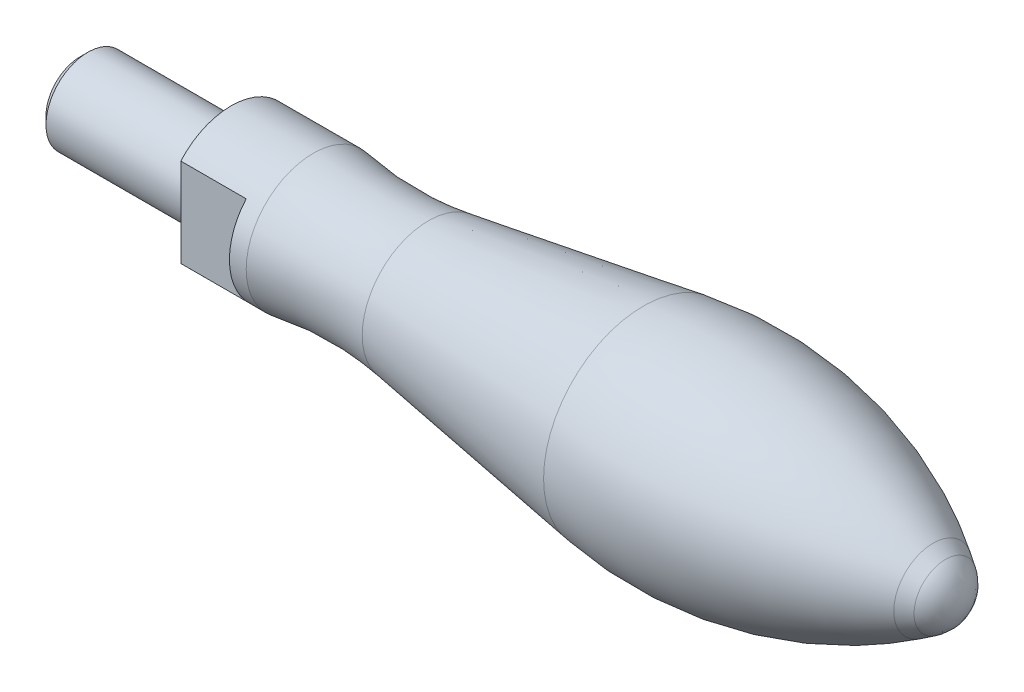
ISO-10303-21;
HEADER;
FILE_DESCRIPTION(('STEP AP214'),'2;1');
FILE_NAME('part.step','',(''),(''),'','','');
FILE_SCHEMA(('AUTOMOTIVE_DESIGN { 1 0 10303 214 1 1 1 1 }'));
ENDSEC;
DATA;
#1=APPLICATION_CONTEXT('core data for automotive mechanical design processes');
#2=APPLICATION_PROTOCOL_DEFINITION('international standard','automotive_design',2000,#1);
#3=PRODUCT_CONTEXT('',#1,'mechanical');
#4=PRODUCT('Part','Part','',(#3));
#5=PRODUCT_RELATED_PRODUCT_CATEGORY('part','',(#4));
#6=PRODUCT_DEFINITION_FORMATION('','',#4);
#7=PRODUCT_DEFINITION_CONTEXT('part definition',#1,'design');
#8=PRODUCT_DEFINITION('design','',#6,#7);
#9=PRODUCT_DEFINITION_SHAPE('','',#8);
#10=(LENGTH_UNIT() NAMED_UNIT(*) SI_UNIT(.MILLI.,.METRE.));
#11=(NAMED_UNIT(*) PLANE_ANGLE_UNIT() SI_UNIT($,.RADIAN.));
#12=(NAMED_UNIT(*) SI_UNIT($,.STERADIAN.) SOLID_ANGLE_UNIT());
#13=UNCERTAINTY_MEASURE_WITH_UNIT(LENGTH_MEASURE(1.E-05),#10,'distance_accuracy_value','');
#14=(GEOMETRIC_REPRESENTATION_CONTEXT(3) GLOBAL_UNCERTAINTY_ASSIGNED_CONTEXT((#13)) GLOBAL_UNIT_ASSIGNED_CONTEXT((#10,
#11,#12)) REPRESENTATION_CONTEXT('',''));
#15=CARTESIAN_POINT('',(0.,0.,0.));
#16=DIRECTION('',(0.,0.,1.));
#17=DIRECTION('',(1.,0.,0.));
#18=AXIS2_PLACEMENT_3D('',#15,#16,#17);
#19=CARTESIAN_POINT('',(0.,0.,0.));
#20=DIRECTION('',(1.,0.,0.));
#21=DIRECTION('',(0.,0.,-1.));
#22=AXIS2_PLACEMENT_3D('',#19,#20,#21);
#23=PLANE('',#22);
#24=CARTESIAN_POINT('',(0.,0.,0.));
#25=DIRECTION('',(-1.,0.,0.));
#26=DIRECTION('',(0.,0.,1.));
#27=AXIS2_PLACEMENT_3D('',#24,#25,#26);
#28=CIRCLE('',#27,8.);
#29=CARTESIAN_POINT('',(0.,5.2915026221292,6.));
#30=VERTEX_POINT('',#29);
#31=CARTESIAN_POINT('',(0.,5.2915026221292,-6.));
#32=VERTEX_POINT('',#31);
#33=EDGE_CURVE('E105',#30,#32,#28,.T.);
#34=ORIENTED_EDGE('',*,*,#33,.T.);
#35=DIRECTION('',(0.,1.,0.));
#36=VECTOR('',#35,1.);
#37=CARTESIAN_POINT('',(0.,-5.2915026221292,-6.));
#38=LINE('',#37,#36);
#39=CARTESIAN_POINT('',(0.,-5.2915026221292,-6.));
#40=VERTEX_POINT('',#39);
#41=EDGE_CURVE('E82',#40,#32,#38,.T.);
#42=ORIENTED_EDGE('',*,*,#41,.F.);
#43=CARTESIAN_POINT('',(0.,-5.2915026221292,6.));
#44=VERTEX_POINT('',#43);
#45=EDGE_CURVE('E95',#40,#44,#28,.T.);
#46=ORIENTED_EDGE('',*,*,#45,.T.);
#47=DIRECTION('',(0.,-1.,0.));
#48=VECTOR('',#47,1.);
#49=CARTESIAN_POINT('',(0.,5.2915026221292,6.));
#50=LINE('',#49,#48);
#51=EDGE_CURVE('E76',#30,#44,#50,.T.);
#52=ORIENTED_EDGE('',*,*,#51,.F.);
#53=EDGE_LOOP('',(#34,#42,#46,#52));
#54=FACE_BOUND('',#53,.T.);
#55=CARTESIAN_POINT('',(0.,0.,0.));
#56=DIRECTION('',(1.,0.,0.));
#57=DIRECTION('',(0.,0.,-1.));
#58=AXIS2_PLACEMENT_3D('',#55,#56,#57);
#59=CIRCLE('',#58,5.);
#60=CARTESIAN_POINT('',(0.,0.,-5.));
#61=VERTEX_POINT('',#60);
#62=EDGE_CURVE('E121',#61,#61,#59,.F.);
#63=ORIENTED_EDGE('',*,*,#62,.F.);
#64=EDGE_LOOP('',(#63));
#65=FACE_BOUND('',#64,.T.);
#66=ADVANCED_FACE('F32',(#54,#65),#23,.F.);
#67=CARTESIAN_POINT('',(82.7999999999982,0.,-0.0500000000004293));
#68=DIRECTION('',(0.,-1.,0.));
#69=DIRECTION('',(0.,0.,1.));
#70=AXIS2_PLACEMENT_3D('',#67,#68,#69);
#71=CIRCLE('',#70,4.50000000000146);
#72=TRIMMED_CURVE('',#71,(PARAMETER_VALUE(-1.55968498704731)),
(PARAMETER_VALUE(1.55968498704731)),.T.,.PARAMETER.);
#73=CARTESIAN_POINT('',(82.7999999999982,0.,0.));
#74=DIRECTION('',(-1.,0.,0.));
#75=AXIS1_PLACEMENT('',#73,#74);
#76=SURFACE_OF_REVOLUTION('',#72,#75);
#77=CARTESIAN_POINT('',(85.215509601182,0.,0.));
#78=DIRECTION('',(-1.,0.,0.));
#79=DIRECTION('',(0.,0.,1.));
#80=AXIS2_PLACEMENT_3D('',#77,#78,#79);
#81=CIRCLE('',#80,3.7467503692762);
#82=CARTESIAN_POINT('',(85.215509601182,0.,3.7467503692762));
#83=VERTEX_POINT('',#82);
#84=EDGE_CURVE('E119',#83,#83,#81,.T.);
#85=ORIENTED_EDGE('',*,*,#84,.F.);
#86=EDGE_LOOP('',(#85));
#87=FACE_BOUND('',#86,.T.);
#88=CARTESIAN_POINT('',(87.299722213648,0.,0.));
#89=VERTEX_POINT('',#88);
#90=VERTEX_LOOP('',#89);
#91=FACE_BOUND('',#90,.T.);
#92=ADVANCED_FACE('F34',(#87,#91),#76,.T.);
#93=CARTESIAN_POINT('',(85.215509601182,0.,0.));
#94=DIRECTION('',(-1.,0.,0.));
#95=DIRECTION('',(0.,0.,1.));
#96=AXIS2_PLACEMENT_3D('',#93,#94,#95);
#97=CONICAL_SURFACE('',#96,3.7467503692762,0.566615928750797);
#98=CARTESIAN_POINT('',(83.738995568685,0.,0.));
#99=DIRECTION('',(-1.,0.,0.));
#100=DIRECTION('',(0.,0.,1.));
#101=AXIS2_PLACEMENT_3D('',#98,#99,#100);
#102=CIRCLE('',#101,4.6861152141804);
#103=CARTESIAN_POINT('',(83.738995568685,0.,4.6861152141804));
#104=VERTEX_POINT('',#103);
#105=EDGE_CURVE('E116',#104,#104,#102,.T.);
#106=ORIENTED_EDGE('',*,*,#105,.F.);
#107=EDGE_LOOP('',(#106));
#108=FACE_BOUND('',#107,.T.);
#109=ORIENTED_EDGE('',*,*,#84,.T.);
#110=EDGE_LOOP('',(#109));
#111=FACE_BOUND('',#110,.T.);
#112=ADVANCED_FACE('F142',(#108,#111),#97,.T.);
#113=CARTESIAN_POINT('',(56.8999999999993,0.,0.));
#114=DIRECTION('',(-1.,0.,0.));
#115=DIRECTION('',(0.,0.,1.));
#116=AXIS2_PLACEMENT_3D('',#113,#114,#115);
#117=DEGENERATE_TOROIDAL_SURFACE('',#116,37.5000000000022,50.0000000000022,.F.);
#118=CARTESIAN_POINT('',(49.175873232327,0.,0.));
#119=DIRECTION('',(-1.,0.,0.));
#120=DIRECTION('',(0.,0.,1.));
#121=AXIS2_PLACEMENT_3D('',#118,#119,#120);
#122=CIRCLE('',#121,11.899775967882);
#123=CARTESIAN_POINT('',(49.175873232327,0.,11.899775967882));
#124=VERTEX_POINT('',#123);
#125=EDGE_CURVE('E113',#124,#124,#122,.T.);
#126=ORIENTED_EDGE('',*,*,#125,.F.);
#127=EDGE_LOOP('',(#126));
#128=FACE_BOUND('',#127,.T.);
#129=ORIENTED_EDGE('',*,*,#105,.T.);
#130=EDGE_LOOP('',(#129));
#131=FACE_BOUND('',#130,.T.);
#132=ADVANCED_FACE('F157',(#128,#131),#117,.F.);
#133=CARTESIAN_POINT('',(49.175873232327,0.,0.));
#134=DIRECTION('',(1.,0.,0.));
#135=DIRECTION('',(0.,0.,-1.));
#136=AXIS2_PLACEMENT_3D('',#133,#134,#135);
#137=CONICAL_SURFACE('',#136,11.899775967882,0.15510367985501);
#138=CARTESIAN_POINT('',(23.534611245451,0.,0.));
#139=DIRECTION('',(-1.,0.,0.));
#140=DIRECTION('',(0.,0.,1.));
#141=AXIS2_PLACEMENT_3D('',#138,#139,#140);
#142=CIRCLE('',#141,7.8905197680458);
#143=CARTESIAN_POINT('',(23.534611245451,0.,7.8905197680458));
#144=VERTEX_POINT('',#143);
#145=EDGE_CURVE('E110',#144,#144,#142,.T.);
#146=ORIENTED_EDGE('',*,*,#145,.F.);
#147=EDGE_LOOP('',(#146));
#148=FACE_BOUND('',#147,.T.);
#149=ORIENTED_EDGE('',*,*,#125,.T.);
#150=EDGE_LOOP('',(#149));
#151=FACE_BOUND('',#150,.T.);
#152=ADVANCED_FACE('F153',(#148,#151),#137,.T.);
#153=CARTESIAN_POINT('',(16.9999999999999,0.,0.));
#154=DIRECTION('',(-1.,0.,0.));
#155=DIRECTION('',(0.,0.,1.));
#156=AXIS2_PLACEMENT_3D('',#153,#154,#155);
#157=TOROIDAL_SURFACE('',#156,49.6827302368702,42.2999999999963);
#158=CARTESIAN_POINT('',(9.8,0.,0.));
#159=DIRECTION('',(-1.,0.,0.));
#160=DIRECTION('',(0.,0.,1.));
#161=AXIS2_PLACEMENT_3D('',#158,#159,#160);
#162=CIRCLE('',#161,8.);
#163=CARTESIAN_POINT('',(9.8,0.,8.));
#164=VERTEX_POINT('',#163);
#165=EDGE_CURVE('E107',#164,#164,#162,.T.);
#166=ORIENTED_EDGE('',*,*,#165,.F.);
#167=EDGE_LOOP('',(#166));
#168=FACE_BOUND('',#167,.T.);
#169=ORIENTED_EDGE('',*,*,#145,.T.);
#170=EDGE_LOOP('',(#169));
#171=FACE_BOUND('',#170,.T.);
#172=ADVANCED_FACE('F150',(#168,#171),#157,.F.);
#173=CARTESIAN_POINT('',(87.3,0.,0.));
#174=DIRECTION('',(-1.,0.,0.));
#175=DIRECTION('',(0.,0.,1.));
#176=AXIS2_PLACEMENT_3D('',#173,#174,#175);
#177=CYLINDRICAL_SURFACE('',#176,8.);
#178=CARTESIAN_POINT('',(7.8,0.,0.));
#179=DIRECTION('',(1.,0.,0.));
#180=DIRECTION('',(0.,0.,-1.));
#181=AXIS2_PLACEMENT_3D('',#178,#179,#180);
#182=CIRCLE('',#181,8.);
#183=CARTESIAN_POINT('',(7.8,5.29150262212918,6.));
#184=VERTEX_POINT('',#183);
#185=CARTESIAN_POINT('',(7.8,-5.2915026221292,6.));
#186=VERTEX_POINT('',#185);
#187=EDGE_CURVE('E36',#184,#186,#182,.T.);
#188=ORIENTED_EDGE('',*,*,#187,.T.);
#189=DIRECTION('',(-1.,0.,0.));
#190=VECTOR('',#189,1.);
#191=CARTESIAN_POINT('',(7.8,-5.2915026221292,6.));
#192=LINE('',#191,#190);
#193=EDGE_CURVE('E126',#186,#44,#192,.T.);
#194=ORIENTED_EDGE('',*,*,#193,.T.);
#195=ORIENTED_EDGE('',*,*,#45,.F.);
#196=DIRECTION('',(-1.,0.,0.));
#197=VECTOR('',#196,1.);
#198=CARTESIAN_POINT('',(7.8,-5.2915026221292,-6.));
#199=LINE('',#198,#197);
#200=CARTESIAN_POINT('',(7.8,-5.29150262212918,-6.));
#201=VERTEX_POINT('',#200);
#202=EDGE_CURVE('E86',#201,#40,#199,.T.);
#203=ORIENTED_EDGE('',*,*,#202,.F.);
#204=CARTESIAN_POINT('',(7.8,5.2915026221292,-6.));
#205=VERTEX_POINT('',#204);
#206=EDGE_CURVE('E11',#201,#205,#182,.T.);
#207=ORIENTED_EDGE('',*,*,#206,.T.);
#208=DIRECTION('',(-1.,0.,0.));
#209=VECTOR('',#208,1.);
#210=CARTESIAN_POINT('',(7.8,5.2915026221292,-6.));
#211=LINE('',#210,#209);
#212=EDGE_CURVE('E79',#205,#32,#211,.T.);
#213=ORIENTED_EDGE('',*,*,#212,.T.);
#214=ORIENTED_EDGE('',*,*,#33,.F.);
#215=DIRECTION('',(-1.,0.,0.));
#216=VECTOR('',#215,1.);
#217=CARTESIAN_POINT('',(7.8,5.2915026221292,6.));
#218=LINE('',#217,#216);
#219=EDGE_CURVE('E87',#184,#30,#218,.T.);
#220=ORIENTED_EDGE('',*,*,#219,.F.);
#221=EDGE_LOOP('',(#188,#194,#195,#203,#207,#213,#214,#220));
#222=FACE_BOUND('',#221,.T.);
#223=ORIENTED_EDGE('',*,*,#165,.T.);
#224=EDGE_LOOP('',(#223));
#225=FACE_BOUND('',#224,.T.);
#226=ADVANCED_FACE('F90',(#222,#225),#177,.T.);
#227=CARTESIAN_POINT('',(-18.,0.,0.));
#228=DIRECTION('',(1.,0.,0.));
#229=DIRECTION('',(0.,0.,-1.));
#230=AXIS2_PLACEMENT_3D('',#227,#228,#229);
#231=PLANE('',#230);
#232=CARTESIAN_POINT('',(-18.,0.,0.));
#233=DIRECTION('',(-1.,0.,0.));
#234=DIRECTION('',(0.,0.,1.));
#235=AXIS2_PLACEMENT_3D('',#232,#233,#234);
#236=CIRCLE('',#235,4.08);
#237=CARTESIAN_POINT('',(-18.,0.,4.08));
#238=VERTEX_POINT('',#237);
#239=EDGE_CURVE('E99',#238,#238,#236,.T.);
#240=ORIENTED_EDGE('',*,*,#239,.T.);
#241=EDGE_LOOP('',(#240));
#242=FACE_BOUND('',#241,.T.);
#243=ADVANCED_FACE('F146',(#242),#231,.F.);
#244=CARTESIAN_POINT('',(-17.08,0.,0.));
#245=DIRECTION('',(1.,0.,0.));
#246=DIRECTION('',(0.,0.,-1.));
#247=AXIS2_PLACEMENT_3D('',#244,#245,#246);
#248=CONICAL_SURFACE('',#247,5.,0.78539816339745);
#249=ORIENTED_EDGE('',*,*,#239,.F.);
#250=EDGE_LOOP('',(#249));
#251=FACE_BOUND('',#250,.T.);
#252=CARTESIAN_POINT('',(-17.08,0.,0.));
#253=DIRECTION('',(-1.,0.,0.));
#254=DIRECTION('',(0.,0.,1.));
#255=AXIS2_PLACEMENT_3D('',#252,#253,#254);
#256=CIRCLE('',#255,5.);
#257=CARTESIAN_POINT('',(-17.08,0.,5.));
#258=VERTEX_POINT('',#257);
#259=EDGE_CURVE('E96',#258,#258,#256,.T.);
#260=ORIENTED_EDGE('',*,*,#259,.T.);
#261=EDGE_LOOP('',(#260));
#262=FACE_BOUND('',#261,.T.);
#263=ADVANCED_FACE('F195',(#251,#262),#248,.T.);
#264=CARTESIAN_POINT('',(0.,0.,0.));
#265=DIRECTION('',(-1.,0.,0.));
#266=DIRECTION('',(0.,0.,1.));
#267=AXIS2_PLACEMENT_3D('',#264,#265,#266);
#268=CYLINDRICAL_SURFACE('',#267,5.);
#269=ORIENTED_EDGE('',*,*,#259,.F.);
#270=EDGE_LOOP('',(#269));
#271=FACE_BOUND('',#270,.T.);
#272=ORIENTED_EDGE('',*,*,#62,.T.);
#273=EDGE_LOOP('',(#272));
#274=FACE_BOUND('',#273,.T.);
#275=ADVANCED_FACE('F202',(#271,#274),#268,.T.);
#276=CARTESIAN_POINT('',(7.8,5.2915026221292,6.));
#277=DIRECTION('',(0.,0.,-1.));
#278=DIRECTION('',(-1.,0.,0.));
#279=AXIS2_PLACEMENT_3D('',#276,#277,#278);
#280=PLANE('',#279);
#281=ORIENTED_EDGE('',*,*,#51,.T.);
#282=ORIENTED_EDGE('',*,*,#193,.F.);
#283=DIRECTION('',(0.,-1.,0.));
#284=VECTOR('',#283,1.);
#285=CARTESIAN_POINT('',(7.8,5.2915026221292,6.));
#286=LINE('',#285,#284);
#287=EDGE_CURVE('E55',#184,#186,#286,.T.);
#288=ORIENTED_EDGE('',*,*,#287,.F.);
#289=ORIENTED_EDGE('',*,*,#219,.T.);
#290=EDGE_LOOP('',(#281,#282,#288,#289));
#291=FACE_BOUND('',#290,.T.);
#292=ADVANCED_FACE('F130',(#291),#280,.F.);
#293=CARTESIAN_POINT('',(7.8,0.,0.));
#294=DIRECTION('',(1.,0.,0.));
#295=DIRECTION('',(0.,0.,-1.));
#296=AXIS2_PLACEMENT_3D('',#293,#294,#295);
#297=PLANE('',#296);
#298=ORIENTED_EDGE('',*,*,#287,.T.);
#299=ORIENTED_EDGE('',*,*,#187,.F.);
#300=EDGE_LOOP('',(#298,#299));
#301=FACE_BOUND('',#300,.T.);
#302=ADVANCED_FACE('F128',(#301),#297,.F.);
#303=DIRECTION('',(0.,1.,0.));
#304=VECTOR('',#303,1.);
#305=CARTESIAN_POINT('',(7.8,-5.2915026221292,-6.));
#306=LINE('',#305,#304);
#307=EDGE_CURVE('E47',#201,#205,#306,.T.);
#308=ORIENTED_EDGE('',*,*,#307,.T.);
#309=ORIENTED_EDGE('',*,*,#206,.F.);
#310=EDGE_LOOP('',(#308,#309));
#311=FACE_BOUND('',#310,.T.);
#312=ADVANCED_FACE('F74',(#311),#297,.F.);
#313=CARTESIAN_POINT('',(7.8,-5.2915026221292,-6.));
#314=DIRECTION('',(0.,0.,1.));
#315=DIRECTION('',(1.,0.,0.));
#316=AXIS2_PLACEMENT_3D('',#313,#314,#315);
#317=PLANE('',#316);
#318=ORIENTED_EDGE('',*,*,#41,.T.);
#319=ORIENTED_EDGE('',*,*,#212,.F.);
#320=ORIENTED_EDGE('',*,*,#307,.F.);
#321=ORIENTED_EDGE('',*,*,#202,.T.);
#322=EDGE_LOOP('',(#318,#319,#320,#321));
#323=FACE_BOUND('',#322,.T.);
#324=ADVANCED_FACE('F80',(#323),#317,.F.);
#325=CLOSED_SHELL('',(#66,#92,#112,#132,#152,#172,#226,#243,#263,#275,#292,#302,#312,#324));
#326=MANIFOLD_SOLID_BREP('B2',#325);
#327=ADVANCED_BREP_SHAPE_REPRESENTATION('',(#18,#326),#14);
#328=SHAPE_DEFINITION_REPRESENTATION(#9,#327);
ENDSEC;
END-ISO-10303-21;
